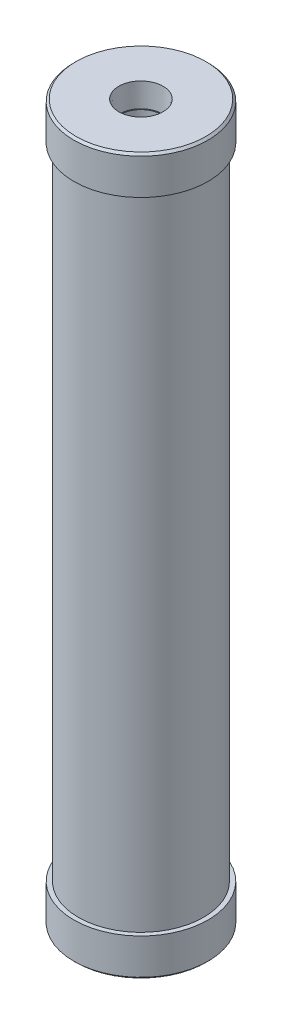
from build123d import *

# Parameters (mm, degrees)
SKETCH1_R           = 44.45
SKETCH1_R_2         = 38.6334
BOSS_EXTRUDE1_DEPTH = 508
SKETCH2_R           = 47.625
BOSS_EXTRUDE2_DEPTH = 26.924
BOSS_EXTRUDE3_START = -26.924
SKETCH5_R           = 47.625
BOSS_EXTRUDE3_DEPTH = 26.924
CHAMFER1_SIZE       = 1.524


with BuildPart() as part:
    # Sketch1 → Boss-Extrude1 (new body)
    with BuildSketch(Plane(origin=(0, 0, 0), x_dir=(1, 0, 0), z_dir=(0, 1, 0))):
        with Locations(Location((0, 0, 0), (0, 0, 270))):
            Circle(SKETCH1_R)
        with Locations(Location((0, 0, 0), (0, 0, 270))):
            Circle(SKETCH1_R_2, mode=Mode.SUBTRACT)
    extrude(amount=BOSS_EXTRUDE1_DEPTH)

    # Sketch2 → Boss-Extrude2 (add)
    with BuildSketch(Plane(origin=(0, 0, 0), x_dir=(1, 0, 0), z_dir=(0, 1, 0))):
        with Locations(Location((0, 0, 0), (0, 0, 270))):
            Circle(SKETCH2_R)
    extrude(amount=BOSS_EXTRUDE2_DEPTH)

    # Sketch3 → 1 NPT Tapped Hole1 (revolve, cut)
    with BuildSketch(Plane(origin=(0, 0, 0), x_dir=(0, 0, -1), z_dir=(1, 0, 0))):
        Polygon((0, 0), (0, 36.646890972), (14.4907, 27.94), (14.4907, 16.764), (15.22797859, 16.764), (15.7299152, 0), align=None)
    revolve(axis=Axis((0, -6.35, 0), (0, 1, 0)), mode=Mode.SUBTRACT)

    # Sketch5 → Boss-Extrude3 (add)
    with BuildSketch(Plane(origin=(0, 508, 0), x_dir=(1, 0, 0), z_dir=(0, 1, 0)).offset(BOSS_EXTRUDE3_START)):
        with Locations(Location((0, 0, 0), (0, 0, 270))):
            Circle(SKETCH5_R)
    extrude(amount=BOSS_EXTRUDE3_DEPTH)

    # Sketch6 → 1 NPT Tapped Hole2 (revolve, cut)
    with BuildSketch(Plane(origin=(0, 508, 0), x_dir=(0, 0, 1), z_dir=(1, 0, 0))):
        Polygon((0, 0), (0, 36.646890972), (14.4907, 27.94), (14.4907, 16.764), (15.22797859, 16.764), (15.7299152, 0), align=None)
    revolve(axis=Axis((0, 514.35, 0), (0, -1, 0)), mode=Mode.SUBTRACT)

    # Chamfer1
    chamfer1_edges = [part.edges().sort_by_distance(p)[0] for p in [
        (0, 0, -47.625),
        (0, 508, -47.625),
    ]]
    chamfer(chamfer1_edges, length=CHAMFER1_SIZE)


solid = part.part
